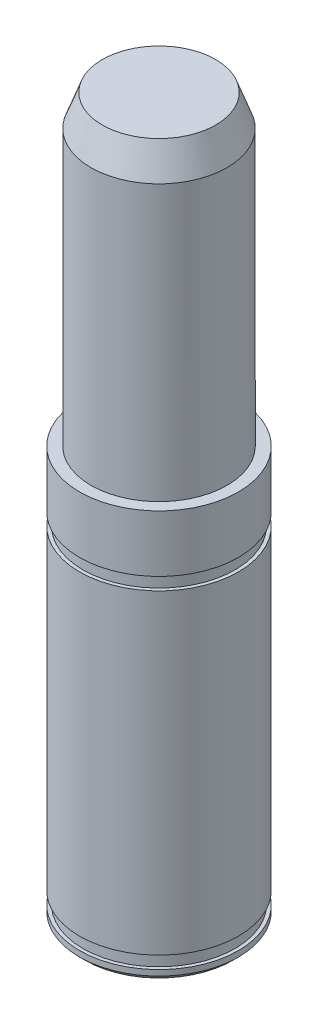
ISO-10303-21;
HEADER;
FILE_DESCRIPTION(('STEP AP214'),'2;1');
FILE_NAME('part.step','',(''),(''),'','','');
FILE_SCHEMA(('AUTOMOTIVE_DESIGN { 1 0 10303 214 1 1 1 1 }'));
ENDSEC;
DATA;
#1=APPLICATION_CONTEXT('core data for automotive mechanical design processes');
#2=APPLICATION_PROTOCOL_DEFINITION('international standard','automotive_design',2000,#1);
#3=PRODUCT_CONTEXT('',#1,'mechanical');
#4=PRODUCT('Part','Part','',(#3));
#5=PRODUCT_RELATED_PRODUCT_CATEGORY('part','',(#4));
#6=PRODUCT_DEFINITION_FORMATION('','',#4);
#7=PRODUCT_DEFINITION_CONTEXT('part definition',#1,'design');
#8=PRODUCT_DEFINITION('design','',#6,#7);
#9=PRODUCT_DEFINITION_SHAPE('','',#8);
#10=(LENGTH_UNIT() NAMED_UNIT(*) SI_UNIT(.MILLI.,.METRE.));
#11=(NAMED_UNIT(*) PLANE_ANGLE_UNIT() SI_UNIT($,.RADIAN.));
#12=(NAMED_UNIT(*) SI_UNIT($,.STERADIAN.) SOLID_ANGLE_UNIT());
#13=UNCERTAINTY_MEASURE_WITH_UNIT(LENGTH_MEASURE(1.E-05),#10,'distance_accuracy_value','');
#14=(GEOMETRIC_REPRESENTATION_CONTEXT(3) GLOBAL_UNCERTAINTY_ASSIGNED_CONTEXT((#13)) GLOBAL_UNIT_ASSIGNED_CONTEXT((#10,
#11,#12)) REPRESENTATION_CONTEXT('',''));
#15=CARTESIAN_POINT('',(0.,0.,0.));
#16=DIRECTION('',(0.,0.,1.));
#17=DIRECTION('',(1.,0.,0.));
#18=AXIS2_PLACEMENT_3D('',#15,#16,#17);
#19=CARTESIAN_POINT('',(0.,27.,0.));
#20=DIRECTION('',(0.,-1.,0.));
#21=DIRECTION('',(0.,0.,-1.));
#22=AXIS2_PLACEMENT_3D('',#19,#20,#21);
#23=PLANE('',#22);
#24=CARTESIAN_POINT('',(0.,27.,0.));
#25=DIRECTION('',(0.,-1.,0.));
#26=DIRECTION('',(0.,0.,-1.));
#27=AXIS2_PLACEMENT_3D('',#24,#25,#26);
#28=CIRCLE('',#27,4.99908185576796);
#29=CARTESIAN_POINT('',(0.,27.,-4.99908185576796));
#30=VERTEX_POINT('',#29);
#31=EDGE_CURVE('E50',#30,#30,#28,.F.);
#32=ORIENTED_EDGE('',*,*,#31,.T.);
#33=EDGE_LOOP('',(#32));
#34=FACE_BOUND('',#33,.T.);
#35=ADVANCED_FACE('F36',(#34),#23,.F.);
#36=CARTESIAN_POINT('',(0.,78.4280701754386,0.));
#37=DIRECTION('',(0.,1.,0.));
#38=DIRECTION('',(0.,0.,1.));
#39=AXIS2_PLACEMENT_3D('',#36,#37,#38);
#40=CYLINDRICAL_SURFACE('',#39,6.00000000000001);
#41=CARTESIAN_POINT('',(0.,24.25,0.));
#42=DIRECTION('',(0.,-1.,0.));
#43=DIRECTION('',(0.,0.,-1.));
#44=AXIS2_PLACEMENT_3D('',#41,#42,#43);
#45=CIRCLE('',#44,6.00000000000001);
#46=CARTESIAN_POINT('',(0.,24.25,-6.00000000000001));
#47=VERTEX_POINT('',#46);
#48=EDGE_CURVE('E46',#47,#47,#45,.T.);
#49=ORIENTED_EDGE('',*,*,#48,.T.);
#50=EDGE_LOOP('',(#49));
#51=FACE_BOUND('',#50,.T.);
#52=CARTESIAN_POINT('',(0.,0.,0.));
#53=DIRECTION('',(0.,1.,0.));
#54=DIRECTION('',(0.,0.,1.));
#55=AXIS2_PLACEMENT_3D('',#52,#53,#54);
#56=CIRCLE('',#55,6.00000000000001);
#57=CARTESIAN_POINT('',(0.,0.,6.00000000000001));
#58=VERTEX_POINT('',#57);
#59=EDGE_CURVE('E55',#58,#58,#56,.T.);
#60=ORIENTED_EDGE('',*,*,#59,.T.);
#61=EDGE_LOOP('',(#60));
#62=FACE_BOUND('',#61,.T.);
#63=ADVANCED_FACE('F102',(#51,#62),#40,.T.);
#64=CARTESIAN_POINT('',(6.00000000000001,0.,0.));
#65=DIRECTION('',(0.,-1.,0.));
#66=DIRECTION('',(0.,0.,-1.));
#67=AXIS2_PLACEMENT_3D('',#64,#65,#66);
#68=PLANE('',#67);
#69=ORIENTED_EDGE('',*,*,#59,.F.);
#70=EDGE_LOOP('',(#69));
#71=FACE_BOUND('',#70,.T.);
#72=CARTESIAN_POINT('',(0.,0.,0.));
#73=DIRECTION('',(0.,1.,0.));
#74=DIRECTION('',(0.,0.,1.));
#75=AXIS2_PLACEMENT_3D('',#72,#73,#74);
#76=CIRCLE('',#75,7.00000000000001);
#77=CARTESIAN_POINT('',(0.,0.,7.00000000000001));
#78=VERTEX_POINT('',#77);
#79=EDGE_CURVE('E58',#78,#78,#76,.T.);
#80=ORIENTED_EDGE('',*,*,#79,.T.);
#81=EDGE_LOOP('',(#80));
#82=FACE_BOUND('',#81,.T.);
#83=ADVANCED_FACE('F107',(#71,#82),#68,.F.);
#84=CARTESIAN_POINT('',(0.,78.4280701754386,0.));
#85=DIRECTION('',(0.,1.,0.));
#86=DIRECTION('',(0.,0.,1.));
#87=AXIS2_PLACEMENT_3D('',#84,#85,#86);
#88=CYLINDRICAL_SURFACE('',#87,7.00000000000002);
#89=ORIENTED_EDGE('',*,*,#79,.F.);
#90=EDGE_LOOP('',(#89));
#91=FACE_BOUND('',#90,.T.);
#92=CARTESIAN_POINT('',(0.,-5.,0.));
#93=DIRECTION('',(0.,1.,0.));
#94=DIRECTION('',(0.,0.,1.));
#95=AXIS2_PLACEMENT_3D('',#92,#93,#94);
#96=CIRCLE('',#95,7.00000000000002);
#97=CARTESIAN_POINT('',(0.,-5.,7.00000000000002));
#98=VERTEX_POINT('',#97);
#99=EDGE_CURVE('E61',#98,#98,#96,.T.);
#100=ORIENTED_EDGE('',*,*,#99,.T.);
#101=EDGE_LOOP('',(#100));
#102=FACE_BOUND('',#101,.T.);
#103=ADVANCED_FACE('F126',(#91,#102),#88,.T.);
#104=CARTESIAN_POINT('',(6.70000000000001,-5.,0.));
#105=DIRECTION('',(0.,1.,0.));
#106=DIRECTION('',(0.,0.,1.));
#107=AXIS2_PLACEMENT_3D('',#104,#105,#106);
#108=PLANE('',#107);
#109=ORIENTED_EDGE('',*,*,#99,.F.);
#110=EDGE_LOOP('',(#109));
#111=FACE_BOUND('',#110,.T.);
#112=CARTESIAN_POINT('',(0.,-5.,0.));
#113=DIRECTION('',(0.,1.,0.));
#114=DIRECTION('',(0.,0.,1.));
#115=AXIS2_PLACEMENT_3D('',#112,#113,#114);
#116=CIRCLE('',#115,6.70000000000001);
#117=CARTESIAN_POINT('',(0.,-5.,6.70000000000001));
#118=VERTEX_POINT('',#117);
#119=EDGE_CURVE('E64',#118,#118,#116,.T.);
#120=ORIENTED_EDGE('',*,*,#119,.T.);
#121=EDGE_LOOP('',(#120));
#122=FACE_BOUND('',#121,.T.);
#123=ADVANCED_FACE('F132',(#111,#122),#108,.F.);
#124=CARTESIAN_POINT('',(0.,78.4280701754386,0.));
#125=DIRECTION('',(0.,1.,0.));
#126=DIRECTION('',(0.,0.,1.));
#127=AXIS2_PLACEMENT_3D('',#124,#125,#126);
#128=CYLINDRICAL_SURFACE('',#127,6.70000000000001);
#129=ORIENTED_EDGE('',*,*,#119,.F.);
#130=EDGE_LOOP('',(#129));
#131=FACE_BOUND('',#130,.T.);
#132=CARTESIAN_POINT('',(0.,-6.09999999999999,0.));
#133=DIRECTION('',(0.,1.,0.));
#134=DIRECTION('',(0.,0.,1.));
#135=AXIS2_PLACEMENT_3D('',#132,#133,#134);
#136=CIRCLE('',#135,6.70000000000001);
#137=CARTESIAN_POINT('',(0.,-6.09999999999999,6.70000000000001));
#138=VERTEX_POINT('',#137);
#139=EDGE_CURVE('E67',#138,#138,#136,.T.);
#140=ORIENTED_EDGE('',*,*,#139,.T.);
#141=EDGE_LOOP('',(#140));
#142=FACE_BOUND('',#141,.T.);
#143=ADVANCED_FACE('F138',(#131,#142),#128,.T.);
#144=CARTESIAN_POINT('',(7.00000000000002,-6.1,0.));
#145=DIRECTION('',(0.,-1.,0.));
#146=DIRECTION('',(0.,0.,-1.));
#147=AXIS2_PLACEMENT_3D('',#144,#145,#146);
#148=PLANE('',#147);
#149=ORIENTED_EDGE('',*,*,#139,.F.);
#150=EDGE_LOOP('',(#149));
#151=FACE_BOUND('',#150,.T.);
#152=CARTESIAN_POINT('',(0.,-6.09999999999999,0.));
#153=DIRECTION('',(0.,1.,0.));
#154=DIRECTION('',(0.,0.,1.));
#155=AXIS2_PLACEMENT_3D('',#152,#153,#154);
#156=CIRCLE('',#155,7.00000000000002);
#157=CARTESIAN_POINT('',(0.,-6.09999999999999,7.00000000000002));
#158=VERTEX_POINT('',#157);
#159=EDGE_CURVE('E70',#158,#158,#156,.T.);
#160=ORIENTED_EDGE('',*,*,#159,.T.);
#161=EDGE_LOOP('',(#160));
#162=FACE_BOUND('',#161,.T.);
#163=ADVANCED_FACE('F144',(#151,#162),#148,.F.);
#164=CARTESIAN_POINT('',(0.,78.4280701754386,0.));
#165=DIRECTION('',(0.,1.,0.));
#166=DIRECTION('',(0.,0.,1.));
#167=AXIS2_PLACEMENT_3D('',#164,#165,#166);
#168=CYLINDRICAL_SURFACE('',#167,7.00000000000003);
#169=ORIENTED_EDGE('',*,*,#159,.F.);
#170=EDGE_LOOP('',(#169));
#171=FACE_BOUND('',#170,.T.);
#172=CARTESIAN_POINT('',(0.,-33.9,0.));
#173=DIRECTION('',(0.,1.,0.));
#174=DIRECTION('',(0.,0.,1.));
#175=AXIS2_PLACEMENT_3D('',#172,#173,#174);
#176=CIRCLE('',#175,7.00000000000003);
#177=CARTESIAN_POINT('',(0.,-33.9,7.00000000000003));
#178=VERTEX_POINT('',#177);
#179=EDGE_CURVE('E73',#178,#178,#176,.T.);
#180=ORIENTED_EDGE('',*,*,#179,.T.);
#181=EDGE_LOOP('',(#180));
#182=FACE_BOUND('',#181,.T.);
#183=ADVANCED_FACE('F150',(#171,#182),#168,.T.);
#184=CARTESIAN_POINT('',(6.70000000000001,-33.9,0.));
#185=DIRECTION('',(0.,1.,0.));
#186=DIRECTION('',(0.,0.,1.));
#187=AXIS2_PLACEMENT_3D('',#184,#185,#186);
#188=PLANE('',#187);
#189=ORIENTED_EDGE('',*,*,#179,.F.);
#190=EDGE_LOOP('',(#189));
#191=FACE_BOUND('',#190,.T.);
#192=CARTESIAN_POINT('',(0.,-33.9,0.));
#193=DIRECTION('',(0.,1.,0.));
#194=DIRECTION('',(0.,0.,1.));
#195=AXIS2_PLACEMENT_3D('',#192,#193,#194);
#196=CIRCLE('',#195,6.70000000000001);
#197=CARTESIAN_POINT('',(0.,-33.9,6.70000000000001));
#198=VERTEX_POINT('',#197);
#199=EDGE_CURVE('E76',#198,#198,#196,.T.);
#200=ORIENTED_EDGE('',*,*,#199,.T.);
#201=EDGE_LOOP('',(#200));
#202=FACE_BOUND('',#201,.T.);
#203=ADVANCED_FACE('F156',(#191,#202),#188,.F.);
#204=CARTESIAN_POINT('',(0.,78.4280701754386,0.));
#205=DIRECTION('',(0.,1.,0.));
#206=DIRECTION('',(0.,0.,1.));
#207=AXIS2_PLACEMENT_3D('',#204,#205,#206);
#208=CYLINDRICAL_SURFACE('',#207,6.70000000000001);
#209=ORIENTED_EDGE('',*,*,#199,.F.);
#210=EDGE_LOOP('',(#209));
#211=FACE_BOUND('',#210,.T.);
#212=CARTESIAN_POINT('',(0.,-35.,0.));
#213=DIRECTION('',(0.,1.,0.));
#214=DIRECTION('',(0.,0.,1.));
#215=AXIS2_PLACEMENT_3D('',#212,#213,#214);
#216=CIRCLE('',#215,6.70000000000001);
#217=CARTESIAN_POINT('',(0.,-35.,6.70000000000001));
#218=VERTEX_POINT('',#217);
#219=EDGE_CURVE('E79',#218,#218,#216,.T.);
#220=ORIENTED_EDGE('',*,*,#219,.T.);
#221=EDGE_LOOP('',(#220));
#222=FACE_BOUND('',#221,.T.);
#223=ADVANCED_FACE('F98',(#211,#222),#208,.T.);
#224=CARTESIAN_POINT('',(7.00000000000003,-35.,0.));
#225=DIRECTION('',(0.,-1.,0.));
#226=DIRECTION('',(0.,0.,-1.));
#227=AXIS2_PLACEMENT_3D('',#224,#225,#226);
#228=PLANE('',#227);
#229=ORIENTED_EDGE('',*,*,#219,.F.);
#230=EDGE_LOOP('',(#229));
#231=FACE_BOUND('',#230,.T.);
#232=CARTESIAN_POINT('',(0.,-35.,0.));
#233=DIRECTION('',(0.,1.,0.));
#234=DIRECTION('',(0.,0.,1.));
#235=AXIS2_PLACEMENT_3D('',#232,#233,#234);
#236=CIRCLE('',#235,7.00000000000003);
#237=CARTESIAN_POINT('',(0.,-35.,7.00000000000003));
#238=VERTEX_POINT('',#237);
#239=EDGE_CURVE('E82',#238,#238,#236,.T.);
#240=ORIENTED_EDGE('',*,*,#239,.T.);
#241=EDGE_LOOP('',(#240));
#242=FACE_BOUND('',#241,.T.);
#243=ADVANCED_FACE('F86',(#231,#242),#228,.F.);
#244=CARTESIAN_POINT('',(0.,78.4280701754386,0.));
#245=DIRECTION('',(0.,1.,0.));
#246=DIRECTION('',(0.,0.,1.));
#247=AXIS2_PLACEMENT_3D('',#244,#245,#246);
#248=CYLINDRICAL_SURFACE('',#247,7.00000000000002);
#249=CARTESIAN_POINT('',(0.,-35.5,0.));
#250=DIRECTION('',(0.,1.,0.));
#251=DIRECTION('',(0.,0.,1.));
#252=AXIS2_PLACEMENT_3D('',#249,#250,#251);
#253=CIRCLE('',#252,7.00000000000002);
#254=CARTESIAN_POINT('',(0.,-35.5,7.00000000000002));
#255=VERTEX_POINT('',#254);
#256=EDGE_CURVE('E42',#255,#255,#253,.T.);
#257=ORIENTED_EDGE('',*,*,#256,.T.);
#258=EDGE_LOOP('',(#257));
#259=FACE_BOUND('',#258,.T.);
#260=ORIENTED_EDGE('',*,*,#239,.F.);
#261=EDGE_LOOP('',(#260));
#262=FACE_BOUND('',#261,.T.);
#263=ADVANCED_FACE('F88',(#259,#262),#248,.T.);
#264=CARTESIAN_POINT('',(7.00000000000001,-36.,0.));
#265=DIRECTION('',(0.,1.,0.));
#266=DIRECTION('',(0.,0.,1.));
#267=AXIS2_PLACEMENT_3D('',#264,#265,#266);
#268=PLANE('',#267);
#269=CARTESIAN_POINT('',(0.,-36.,0.));
#270=DIRECTION('',(0.,1.,0.));
#271=DIRECTION('',(0.,0.,1.));
#272=AXIS2_PLACEMENT_3D('',#269,#270,#271);
#273=CIRCLE('',#272,6.50000000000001);
#274=CARTESIAN_POINT('',(0.,-36.,6.50000000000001));
#275=VERTEX_POINT('',#274);
#276=EDGE_CURVE('E10',#275,#275,#273,.F.);
#277=ORIENTED_EDGE('',*,*,#276,.T.);
#278=EDGE_LOOP('',(#277));
#279=FACE_BOUND('',#278,.T.);
#280=ADVANCED_FACE('F90',(#279),#268,.F.);
#281=CARTESIAN_POINT('',(0.,27.,0.));
#282=DIRECTION('',(0.,-1.,0.));
#283=DIRECTION('',(0.,0.,-1.));
#284=AXIS2_PLACEMENT_3D('',#281,#282,#283);
#285=CONICAL_SURFACE('',#284,4.99908185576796,0.349065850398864);
#286=ORIENTED_EDGE('',*,*,#48,.F.);
#287=EDGE_LOOP('',(#286));
#288=FACE_BOUND('',#287,.T.);
#289=ORIENTED_EDGE('',*,*,#31,.F.);
#290=EDGE_LOOP('',(#289));
#291=FACE_BOUND('',#290,.T.);
#292=ADVANCED_FACE('F96',(#288,#291),#285,.T.);
#293=CARTESIAN_POINT('',(0.,-35.5,0.));
#294=DIRECTION('',(0.,1.,0.));
#295=DIRECTION('',(0.,0.,1.));
#296=AXIS2_PLACEMENT_3D('',#293,#294,#295);
#297=CONICAL_SURFACE('',#296,7.00000000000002,0.785398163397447);
#298=ORIENTED_EDGE('',*,*,#276,.F.);
#299=EDGE_LOOP('',(#298));
#300=FACE_BOUND('',#299,.T.);
#301=ORIENTED_EDGE('',*,*,#256,.F.);
#302=EDGE_LOOP('',(#301));
#303=FACE_BOUND('',#302,.T.);
#304=ADVANCED_FACE('F112',(#300,#303),#297,.T.);
#305=CLOSED_SHELL('',(#35,#63,#83,#103,#123,#143,#163,#183,#203,#223,#243,#263,#280,#292,#304));
#306=MANIFOLD_SOLID_BREP('B2',#305);
#307=ADVANCED_BREP_SHAPE_REPRESENTATION('',(#18,#306),#14);
#308=SHAPE_DEFINITION_REPRESENTATION(#9,#307);
ENDSEC;
END-ISO-10303-21;
